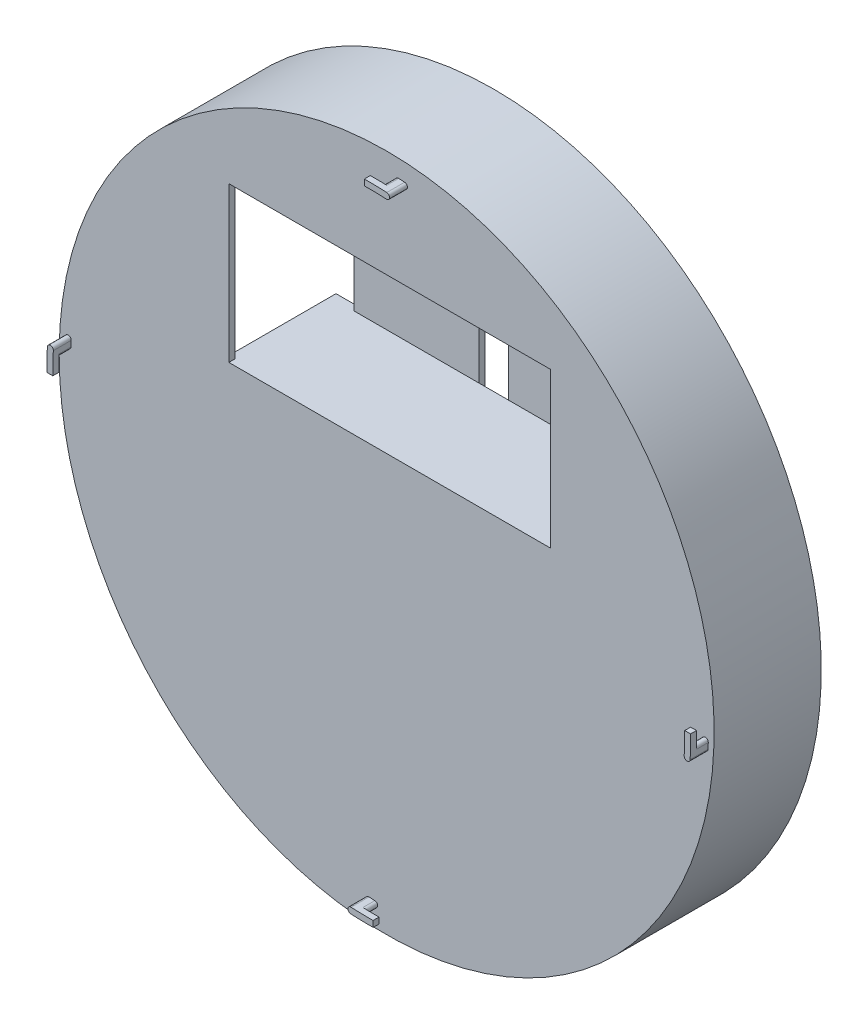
from build123d import *

# Parameters (mm, degrees)
ESQUISSE1_RX                 = 57
ESQUISSE1_RY                 = 55
BOSS_EXTRU_1_DEPTH           = 18
ESQUISSE2_R                  = 50
ENL_V_MAT_EXTRU_1_DEPTH      = 17
ESQUISSE3_W                  = 56
ESQUISSE3_H                  = 28
BOSS_EXTRU_2_DEPTH           = 18
ESQUISSE4_W                  = 54
ESQUISSE4_H                  = 26
ENL_V_MAT_EXTRU_2_DEPTH      = 18
ESQUISSE5_W                  = 5
ESQUISSE5_H                  = 28
ENL_V_MAT_EXTRU_3_DEPTH      = 1
ENL_V_MAT_EXTRU_4_DEPTH      = 5
BOSS_EXTRU_3_DEPTH           = 10
ESQUISSE9_W                  = 4
ESQUISSE9_H                  = 26
ENL_V_MAT_EXTRU_5_DEPTH      = 18
ESQUISSE10_R                 = 3
BOSS_EXTRU_4_DEPTH           = 15
BOSS_EXTRU_5_DEPTH           = 3
ESQUISSE12_W                 = 1
ESQUISSE12_H                 = 1
R_VOLUTION1_ANGLE            = 4
R_P_TITION_CIRCULAIRE1_COUNT = 4


with BuildPart() as part:
    # Esquisse1 → Boss.-Extru.1 (new body)
    with BuildSketch(Plane.XY):
        with Locations(Location((0, 0), (0, 0, 90))):
            Ellipse(ESQUISSE1_RX, ESQUISSE1_RY)
    extrude(amount=BOSS_EXTRU_1_DEPTH)

    # Esquisse2 → Enl_v. mat.-Extru.1 (cut)
    with BuildSketch(Plane(origin=(0, 0, 0), x_dir=(-1, 0, 0), z_dir=(0, 0, -1))):
        Circle(ESQUISSE2_R)
    extrude(amount=-ENL_V_MAT_EXTRU_1_DEPTH, mode=Mode.SUBTRACT)

    # Esquisse3 → Boss.-Extru.2 (add)
    with BuildSketch(Plane(origin=(0, 0, 17), x_dir=(-1, 0, 0), z_dir=(0, 0, -1))):
        with Locations((-0.5, 26)):
            Rectangle(ESQUISSE3_W, ESQUISSE3_H)
    extrude(amount=BOSS_EXTRU_2_DEPTH)

    # Esquisse4 → Enl_v. mat.-Extru.2 (cut)
    with BuildSketch(Plane.XY.offset(18)):
        with Locations((0.5, 26)):
            Rectangle(ESQUISSE4_W, ESQUISSE4_H)
    extrude(amount=-ENL_V_MAT_EXTRU_2_DEPTH, mode=Mode.SUBTRACT)

    # Esquisse5 → Enl_v. mat.-Extru.3 (cut)
    with BuildSketch(Plane(origin=(0, 0, -1), x_dir=(-1, 0, 0), z_dir=(0, 0, -1))):
        with Locations((0, 26)):
            Rectangle(ESQUISSE5_W, ESQUISSE5_H)
    extrude(amount=-ENL_V_MAT_EXTRU_3_DEPTH, mode=Mode.SUBTRACT)

    # Esquisse7 → Enl_v. mat.-Extru.4 (cut)
    with BuildSketch(Plane.ZY.offset(-2.5)):
        Polygon((-1, 40), (-1, 12), (3, 40), align=None)
    extrude(amount=ENL_V_MAT_EXTRU_4_DEPTH, mode=Mode.SUBTRACT)

    # Esquisse8 → Boss.-Extru.3 (add)
    with BuildSketch(Plane(origin=(0, 0, 17), x_dir=(-1, 0, 0), z_dir=(0, 0, -1))):
        Polygon((-5.5, 46), (-5.5, 40), (-2, 40), (-2, 41), (-4.5, 41), (-4.5, 45), (-2, 45), (-2, 46), align=None)
        Polygon((5.5, 46), (5.5, 40), (2, 40), (2, 41), (4.5, 41), (4.5, 45), (2, 45), (2, 46), align=None)
    extrude(amount=BOSS_EXTRU_3_DEPTH)

    # Esquisse9 → Enl_v. mat.-Extru.5 (cut)
    with BuildSketch(Plane(origin=(0, 0, -1), x_dir=(-1, 0, 0), z_dir=(0, 0, -1))):
        with Locations((25.5, 26)):
            Rectangle(ESQUISSE9_W, ESQUISSE9_H)
    extrude(amount=-ENL_V_MAT_EXTRU_5_DEPTH, mode=Mode.SUBTRACT)

    # Esquisse10 → Boss.-Extru.4 (add)
    with BuildSketch(Plane(origin=(0, 0, -1), x_dir=(-1, 0, 0), z_dir=(0, 0, -1))):
        with Locations((-9.5, 26)):
            Circle(ESQUISSE10_R)
        with Locations((9.5, 26)):
            Circle(ESQUISSE10_R)
    extrude(amount=BOSS_EXTRU_4_DEPTH)

    # Esquisse11 → Boss.-Extru.5 (add)
    with BuildSketch(Plane.XY.offset(18)):
        with BuildLine():
            ThreePointArc((-53.973512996, 3.028006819), (-53.999454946, 2.523449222), (-54.020680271, 2.018671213))
            ThreePointArc((-54.020680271, 2.018671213), (-53.53970022, 1.500348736), (-53.021377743, 1.981328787))
            ThreePointArc((-53.021377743, 1.981328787), (-53.000545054, 2.476769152), (-52.975082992, 2.971993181))
            ThreePointArc((-52.975082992, 2.971993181), (-53.446291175, 3.499215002), (-53.973512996, 3.028006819))
        make_face()
        with BuildLine():
            ThreePointArc((3.028006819, 53.973512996), (2.523449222, 53.999454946), (2.018671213, 54.020680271))
            ThreePointArc((2.018671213, 54.020680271), (1.500348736, 53.53970022), (1.981328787, 53.021377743))
            ThreePointArc((1.981328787, 53.021377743), (2.476769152, 53.000545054), (2.971993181, 52.975082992))
            ThreePointArc((2.971993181, 52.975082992), (3.499215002, 53.446291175), (3.028006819, 53.973512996))
        make_face()
        with BuildLine():
            ThreePointArc((53.973512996, -3.028006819), (53.999454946, -2.523449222), (54.020680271, -2.018671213))
            ThreePointArc((54.020680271, -2.018671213), (53.53970022, -1.500348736), (53.021377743, -1.981328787))
            ThreePointArc((53.021377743, -1.981328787), (53.000545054, -2.476769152), (52.975082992, -2.971993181))
            ThreePointArc((52.975082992, -2.971993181), (53.446291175, -3.499215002), (53.973512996, -3.028006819))
        make_face()
        with BuildLine():
            ThreePointArc((-3.028006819, -53.973512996), (-2.523449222, -53.999454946), (-2.018671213, -54.020680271))
            ThreePointArc((-2.018671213, -54.020680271), (-1.500348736, -53.53970022), (-1.981328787, -53.021377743))
            ThreePointArc((-1.981328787, -53.021377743), (-2.476769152, -53.000545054), (-2.971993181, -52.975082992))
            ThreePointArc((-2.971993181, -52.975082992), (-3.499215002, -53.446291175), (-3.028006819, -53.973512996))
        make_face()
    extrude(amount=BOSS_EXTRU_5_DEPTH)

    # Esquisse12 → R_volution1 (revolve)
    with BuildSketch(Plane(origin=(0, 0, 0), x_dir=(0.9984300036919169, -0.05601363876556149, 0), z_dir=(0.056013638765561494, 0.998430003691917, 0))):
        with Locations((-53.55838446, -20.5)):
            Rectangle(ESQUISSE12_W, ESQUISSE12_H)
    r_volution1 = revolve(axis=Axis((0, 0, 17), (0, 0, 1)), revolution_arc=R_VOLUTION1_ANGLE)

    # R_p_tition circulaire1: R_volution1 ×4 about axis
    r_p_tition_circulaire1_axis = Axis((0, 0, 17), (0, 0, -1))
    for i in range(1, R_P_TITION_CIRCULAIRE1_COUNT):
        add(r_volution1.rotate(r_p_tition_circulaire1_axis, i * 360 / R_P_TITION_CIRCULAIRE1_COUNT))


solid = part.part
